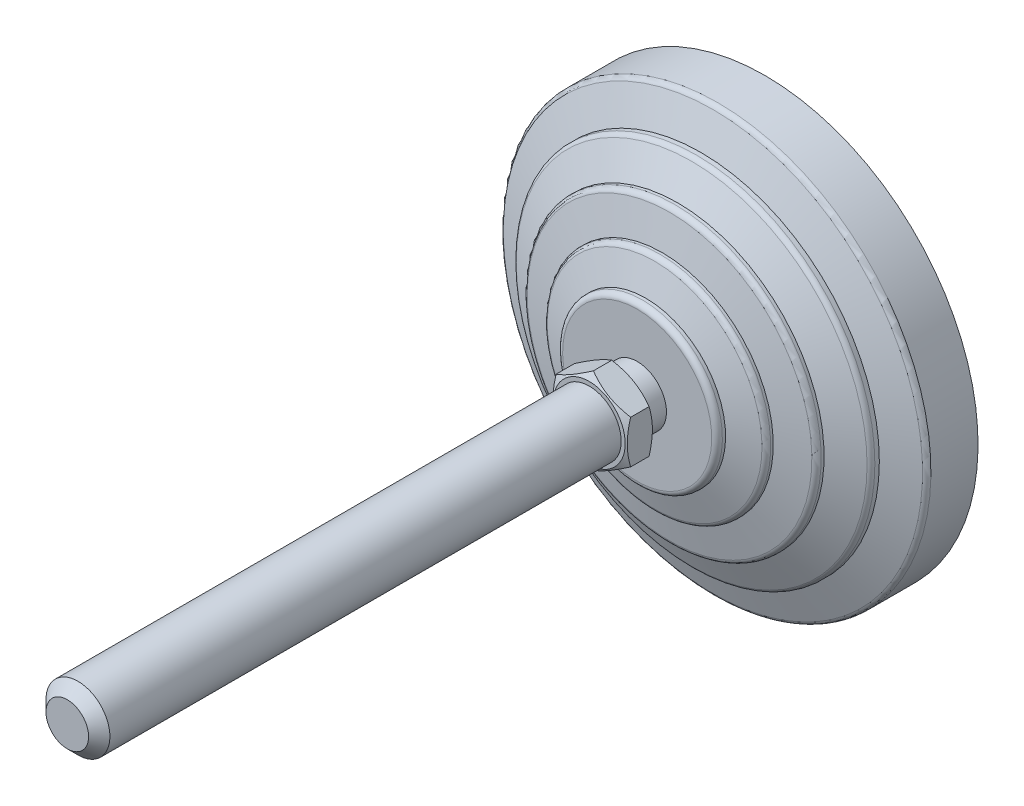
ISO-10303-21;
HEADER;
FILE_DESCRIPTION(('STEP AP214'),'2;1');
FILE_NAME('part.step','',(''),(''),'','','');
FILE_SCHEMA(('AUTOMOTIVE_DESIGN { 1 0 10303 214 1 1 1 1 }'));
ENDSEC;
DATA;
#1=APPLICATION_CONTEXT('core data for automotive mechanical design processes');
#2=APPLICATION_PROTOCOL_DEFINITION('international standard','automotive_design',2000,#1);
#3=PRODUCT_CONTEXT('',#1,'mechanical');
#4=PRODUCT('Part','Part','',(#3));
#5=PRODUCT_RELATED_PRODUCT_CATEGORY('part','',(#4));
#6=PRODUCT_DEFINITION_FORMATION('','',#4);
#7=PRODUCT_DEFINITION_CONTEXT('part definition',#1,'design');
#8=PRODUCT_DEFINITION('design','',#6,#7);
#9=PRODUCT_DEFINITION_SHAPE('','',#8);
#10=(LENGTH_UNIT() NAMED_UNIT(*) SI_UNIT(.MILLI.,.METRE.));
#11=(NAMED_UNIT(*) PLANE_ANGLE_UNIT() SI_UNIT($,.RADIAN.));
#12=(NAMED_UNIT(*) SI_UNIT($,.STERADIAN.) SOLID_ANGLE_UNIT());
#13=UNCERTAINTY_MEASURE_WITH_UNIT(LENGTH_MEASURE(1.E-05),#10,'distance_accuracy_value','');
#14=(GEOMETRIC_REPRESENTATION_CONTEXT(3) GLOBAL_UNCERTAINTY_ASSIGNED_CONTEXT((#13)) GLOBAL_UNIT_ASSIGNED_CONTEXT((#10,
#11,#12)) REPRESENTATION_CONTEXT('',''));
#15=CARTESIAN_POINT('',(0.,0.,0.));
#16=DIRECTION('',(0.,0.,1.));
#17=DIRECTION('',(1.,0.,0.));
#18=AXIS2_PLACEMENT_3D('',#15,#16,#17);
#19=CARTESIAN_POINT('',(-5.5000000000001,0.,28.));
#20=DIRECTION('',(0.,0.,1.));
#21=DIRECTION('',(0.,-1.,0.));
#22=AXIS2_PLACEMENT_3D('',#19,#20,#21);
#23=PLANE('',#22);
#24=CARTESIAN_POINT('',(0.,0.,28.));
#25=DIRECTION('',(0.,0.,-1.));
#26=DIRECTION('',(-1.,0.,0.));
#27=AXIS2_PLACEMENT_3D('',#24,#25,#26);
#28=CIRCLE('',#27,6.75);
#29=CARTESIAN_POINT('',(-6.75,0.,28.));
#30=VERTEX_POINT('',#29);
#31=EDGE_CURVE('E575',#30,#30,#28,.T.);
#32=ORIENTED_EDGE('',*,*,#31,.T.);
#33=EDGE_LOOP('',(#32));
#34=FACE_BOUND('',#33,.T.);
#35=CARTESIAN_POINT('',(0.,0.,28.));
#36=DIRECTION('',(0.,0.,-1.));
#37=DIRECTION('',(0.,1.,0.));
#38=AXIS2_PLACEMENT_3D('',#35,#36,#37);
#39=CIRCLE('',#38,5.5000000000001);
#40=CARTESIAN_POINT('',(0.,5.5000000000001,28.));
#41=VERTEX_POINT('',#40);
#42=EDGE_CURVE('E147',#41,#41,#39,.T.);
#43=ORIENTED_EDGE('',*,*,#42,.F.);
#44=EDGE_LOOP('',(#43));
#45=FACE_BOUND('',#44,.T.);
#46=ADVANCED_FACE('F14',(#34,#45),#23,.F.);
#47=CARTESIAN_POINT('',(0.,0.,0.));
#48=DIRECTION('',(0.,0.,-1.));
#49=DIRECTION('',(0.,1.,0.));
#50=AXIS2_PLACEMENT_3D('',#47,#48,#49);
#51=CYLINDRICAL_SURFACE('',#50,5.5000000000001);
#52=CARTESIAN_POINT('',(0.,0.,24.));
#53=DIRECTION('',(0.,0.,-1.));
#54=DIRECTION('',(0.,1.,0.));
#55=AXIS2_PLACEMENT_3D('',#52,#53,#54);
#56=CIRCLE('',#55,5.5000000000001);
#57=CARTESIAN_POINT('',(0.,5.5000000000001,24.));
#58=VERTEX_POINT('',#57);
#59=EDGE_CURVE('E144',#58,#58,#56,.T.);
#60=ORIENTED_EDGE('',*,*,#59,.F.);
#61=EDGE_LOOP('',(#60));
#62=FACE_BOUND('',#61,.T.);
#63=ORIENTED_EDGE('',*,*,#42,.T.);
#64=EDGE_LOOP('',(#63));
#65=FACE_BOUND('',#64,.T.);
#66=ADVANCED_FACE('F173',(#62,#65),#51,.T.);
#67=CARTESIAN_POINT('',(-5.5000000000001,0.,24.));
#68=DIRECTION('',(0.,0.,-1.));
#69=DIRECTION('',(0.,1.,0.));
#70=AXIS2_PLACEMENT_3D('',#67,#68,#69);
#71=PLANE('',#70);
#72=CARTESIAN_POINT('',(0.,0.,24.));
#73=DIRECTION('',(0.,0.,-1.));
#74=DIRECTION('',(0.,1.,0.));
#75=AXIS2_PLACEMENT_3D('',#72,#73,#74);
#76=CIRCLE('',#75,14.);
#77=CARTESIAN_POINT('',(0.,14.,24.));
#78=VERTEX_POINT('',#77);
#79=EDGE_CURVE('E141',#78,#78,#76,.T.);
#80=ORIENTED_EDGE('',*,*,#79,.F.);
#81=EDGE_LOOP('',(#80));
#82=FACE_BOUND('',#81,.T.);
#83=ORIENTED_EDGE('',*,*,#59,.T.);
#84=EDGE_LOOP('',(#83));
#85=FACE_BOUND('',#84,.T.);
#86=ADVANCED_FACE('F180',(#82,#85),#71,.F.);
#87=CARTESIAN_POINT('',(0.,0.,23.));
#88=DIRECTION('',(0.,0.,-1.));
#89=DIRECTION('',(0.,1.,0.));
#90=AXIS2_PLACEMENT_3D('',#87,#88,#89);
#91=TOROIDAL_SURFACE('',#90,14.,1.);
#92=CARTESIAN_POINT('',(0.,0.,23.));
#93=DIRECTION('',(0.,0.,-1.));
#94=DIRECTION('',(0.,1.,0.));
#95=AXIS2_PLACEMENT_3D('',#92,#93,#94);
#96=CIRCLE('',#95,15.);
#97=CARTESIAN_POINT('',(0.,15.,23.));
#98=VERTEX_POINT('',#97);
#99=EDGE_CURVE('E138',#98,#98,#96,.T.);
#100=ORIENTED_EDGE('',*,*,#99,.F.);
#101=EDGE_LOOP('',(#100));
#102=FACE_BOUND('',#101,.T.);
#103=ORIENTED_EDGE('',*,*,#79,.T.);
#104=EDGE_LOOP('',(#103));
#105=FACE_BOUND('',#104,.T.);
#106=ADVANCED_FACE('F407',(#102,#105),#91,.T.);
#107=CARTESIAN_POINT('',(0.,0.,0.));
#108=DIRECTION('',(0.,0.,-1.));
#109=DIRECTION('',(0.,1.,0.));
#110=AXIS2_PLACEMENT_3D('',#107,#108,#109);
#111=CYLINDRICAL_SURFACE('',#110,15.);
#112=CARTESIAN_POINT('',(0.,0.,22.4025287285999));
#113=DIRECTION('',(0.,0.,-1.));
#114=DIRECTION('',(0.,1.,0.));
#115=AXIS2_PLACEMENT_3D('',#112,#113,#114);
#116=CIRCLE('',#115,15.);
#117=CARTESIAN_POINT('',(0.,15.,22.4025287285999));
#118=VERTEX_POINT('',#117);
#119=EDGE_CURVE('E135',#118,#118,#116,.T.);
#120=ORIENTED_EDGE('',*,*,#119,.F.);
#121=EDGE_LOOP('',(#120));
#122=FACE_BOUND('',#121,.T.);
#123=ORIENTED_EDGE('',*,*,#99,.T.);
#124=EDGE_LOOP('',(#123));
#125=FACE_BOUND('',#124,.T.);
#126=ADVANCED_FACE('F397',(#122,#125),#111,.T.);
#127=CARTESIAN_POINT('',(0.,0.,22.4025287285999));
#128=DIRECTION('',(0.,0.,-1.));
#129=DIRECTION('',(0.,1.,0.));
#130=AXIS2_PLACEMENT_3D('',#127,#128,#129);
#131=CONICAL_SURFACE('',#130,15.,1.25589726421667);
#132=CARTESIAN_POINT('',(0.,0.,20.7216684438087));
#133=DIRECTION('',(0.,0.,-1.));
#134=DIRECTION('',(0.,1.,0.));
#135=AXIS2_PLACEMENT_3D('',#132,#133,#134);
#136=CIRCLE('',#135,20.16016354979);
#137=CARTESIAN_POINT('',(0.,20.16016354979,20.7216684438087));
#138=VERTEX_POINT('',#137);
#139=EDGE_CURVE('E132',#138,#138,#136,.T.);
#140=ORIENTED_EDGE('',*,*,#139,.F.);
#141=EDGE_LOOP('',(#140));
#142=FACE_BOUND('',#141,.T.);
#143=ORIENTED_EDGE('',*,*,#119,.T.);
#144=EDGE_LOOP('',(#143));
#145=FACE_BOUND('',#144,.T.);
#146=ADVANCED_FACE('F387',(#142,#145),#131,.T.);
#147=CARTESIAN_POINT('',(0.,0.,19.7708407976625));
#148=DIRECTION('',(0.,0.,-1.));
#149=DIRECTION('',(0.,1.,0.));
#150=AXIS2_PLACEMENT_3D('',#147,#148,#149);
#151=TOROIDAL_SURFACE('',#150,19.8504430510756,1.);
#152=CARTESIAN_POINT('',(0.,0.,19.7708407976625));
#153=DIRECTION('',(0.,0.,-1.));
#154=DIRECTION('',(0.,1.,0.));
#155=AXIS2_PLACEMENT_3D('',#152,#153,#154);
#156=CIRCLE('',#155,20.8504430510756);
#157=CARTESIAN_POINT('',(0.,20.8504430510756,19.7708407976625));
#158=VERTEX_POINT('',#157);
#159=EDGE_CURVE('E129',#158,#158,#156,.T.);
#160=ORIENTED_EDGE('',*,*,#159,.F.);
#161=EDGE_LOOP('',(#160));
#162=FACE_BOUND('',#161,.T.);
#163=ORIENTED_EDGE('',*,*,#139,.T.);
#164=EDGE_LOOP('',(#163));
#165=FACE_BOUND('',#164,.T.);
#166=ADVANCED_FACE('F377',(#162,#165),#151,.T.);
#167=CARTESIAN_POINT('',(0.,0.,0.));
#168=DIRECTION('',(0.,0.,-1.));
#169=DIRECTION('',(0.,1.,0.));
#170=AXIS2_PLACEMENT_3D('',#167,#168,#169);
#171=CYLINDRICAL_SURFACE('',#170,20.8504430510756);
#172=CARTESIAN_POINT('',(0.,0.,19.2987385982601));
#173=DIRECTION('',(0.,0.,-1.));
#174=DIRECTION('',(0.,1.,0.));
#175=AXIS2_PLACEMENT_3D('',#172,#173,#174);
#176=CIRCLE('',#175,20.8504430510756);
#177=CARTESIAN_POINT('',(0.,20.8504430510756,19.2987385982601));
#178=VERTEX_POINT('',#177);
#179=EDGE_CURVE('E126',#178,#178,#176,.T.);
#180=ORIENTED_EDGE('',*,*,#179,.F.);
#181=EDGE_LOOP('',(#180));
#182=FACE_BOUND('',#181,.T.);
#183=ORIENTED_EDGE('',*,*,#159,.T.);
#184=EDGE_LOOP('',(#183));
#185=FACE_BOUND('',#184,.T.);
#186=ADVANCED_FACE('F367',(#182,#185),#171,.T.);
#187=CARTESIAN_POINT('',(0.,0.,19.2987385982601));
#188=DIRECTION('',(0.,0.,-1.));
#189=DIRECTION('',(0.,1.,0.));
#190=AXIS2_PLACEMENT_3D('',#187,#188,#189);
#191=CONICAL_SURFACE('',#190,20.8504430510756,1.34067144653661);
#192=CARTESIAN_POINT('',(0.,0.,17.9217501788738));
#193=DIRECTION('',(0.,0.,-1.));
#194=DIRECTION('',(0.,1.,0.));
#195=AXIS2_PLACEMENT_3D('',#192,#193,#194);
#196=CIRCLE('',#195,26.7280991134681);
#197=CARTESIAN_POINT('',(0.,26.7280991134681,17.9217501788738));
#198=VERTEX_POINT('',#197);
#199=EDGE_CURVE('E123',#198,#198,#196,.T.);
#200=ORIENTED_EDGE('',*,*,#199,.F.);
#201=EDGE_LOOP('',(#200));
#202=FACE_BOUND('',#201,.T.);
#203=ORIENTED_EDGE('',*,*,#179,.T.);
#204=EDGE_LOOP('',(#203));
#205=FACE_BOUND('',#204,.T.);
#206=ADVANCED_FACE('F357',(#202,#205),#191,.T.);
#207=CARTESIAN_POINT('',(0.,0.,16.9481122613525));
#208=DIRECTION('',(0.,0.,-1.));
#209=DIRECTION('',(0.,1.,0.));
#210=AXIS2_PLACEMENT_3D('',#207,#208,#209);
#211=TOROIDAL_SURFACE('',#210,26.5,1.00000000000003);
#212=CARTESIAN_POINT('',(0.,0.,16.9481122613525));
#213=DIRECTION('',(0.,0.,-1.));
#214=DIRECTION('',(0.,1.,0.));
#215=AXIS2_PLACEMENT_3D('',#212,#213,#214);
#216=CIRCLE('',#215,27.5);
#217=CARTESIAN_POINT('',(0.,27.5,16.9481122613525));
#218=VERTEX_POINT('',#217);
#219=EDGE_CURVE('E120',#218,#218,#216,.T.);
#220=ORIENTED_EDGE('',*,*,#219,.F.);
#221=EDGE_LOOP('',(#220));
#222=FACE_BOUND('',#221,.T.);
#223=ORIENTED_EDGE('',*,*,#199,.T.);
#224=EDGE_LOOP('',(#223));
#225=FACE_BOUND('',#224,.T.);
#226=ADVANCED_FACE('F347',(#222,#225),#211,.T.);
#227=CARTESIAN_POINT('',(0.,0.,0.));
#228=DIRECTION('',(0.,0.,-1.));
#229=DIRECTION('',(0.,1.,0.));
#230=AXIS2_PLACEMENT_3D('',#227,#228,#229);
#231=CYLINDRICAL_SURFACE('',#230,27.5);
#232=CARTESIAN_POINT('',(0.,0.,16.4025287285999));
#233=DIRECTION('',(0.,0.,-1.));
#234=DIRECTION('',(0.,1.,0.));
#235=AXIS2_PLACEMENT_3D('',#232,#233,#234);
#236=CIRCLE('',#235,27.5);
#237=CARTESIAN_POINT('',(0.,27.5,16.4025287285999));
#238=VERTEX_POINT('',#237);
#239=EDGE_CURVE('E117',#238,#238,#236,.T.);
#240=ORIENTED_EDGE('',*,*,#239,.F.);
#241=EDGE_LOOP('',(#240));
#242=FACE_BOUND('',#241,.T.);
#243=ORIENTED_EDGE('',*,*,#219,.T.);
#244=EDGE_LOOP('',(#243));
#245=FACE_BOUND('',#244,.T.);
#246=ADVANCED_FACE('F337',(#242,#245),#231,.T.);
#247=CARTESIAN_POINT('',(0.,0.,16.4025287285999));
#248=DIRECTION('',(0.,0.,-1.));
#249=DIRECTION('',(0.,1.,0.));
#250=AXIS2_PLACEMENT_3D('',#247,#248,#249);
#251=CONICAL_SURFACE('',#250,27.5,1.1202291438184);
#252=CARTESIAN_POINT('',(0.,0.,13.7730910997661));
#253=DIRECTION('',(0.,0.,-1.));
#254=DIRECTION('',(0.,1.,0.));
#255=AXIS2_PLACEMENT_3D('',#252,#253,#254);
#256=CIRCLE('',#255,32.9354761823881);
#257=CARTESIAN_POINT('',(0.,32.9354761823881,13.7730910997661));
#258=VERTEX_POINT('',#257);
#259=EDGE_CURVE('E114',#258,#258,#256,.T.);
#260=ORIENTED_EDGE('',*,*,#259,.F.);
#261=EDGE_LOOP('',(#260));
#262=FACE_BOUND('',#261,.T.);
#263=ORIENTED_EDGE('',*,*,#239,.T.);
#264=EDGE_LOOP('',(#263));
#265=FACE_BOUND('',#264,.T.);
#266=ADVANCED_FACE('F327',(#262,#265),#251,.T.);
#267=CARTESIAN_POINT('',(0.,0.,12.8728908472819));
#268=DIRECTION('',(0.,0.,-1.));
#269=DIRECTION('',(0.,1.,0.));
#270=AXIS2_PLACEMENT_3D('',#267,#268,#269);
#271=TOROIDAL_SURFACE('',#270,32.5,0.999999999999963);
#272=CARTESIAN_POINT('',(0.,0.,12.8728908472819));
#273=DIRECTION('',(0.,0.,-1.));
#274=DIRECTION('',(0.,1.,0.));
#275=AXIS2_PLACEMENT_3D('',#272,#273,#274);
#276=CIRCLE('',#275,33.5);
#277=CARTESIAN_POINT('',(0.,33.5,12.8728908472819));
#278=VERTEX_POINT('',#277);
#279=EDGE_CURVE('E111',#278,#278,#276,.T.);
#280=ORIENTED_EDGE('',*,*,#279,.F.);
#281=EDGE_LOOP('',(#280));
#282=FACE_BOUND('',#281,.T.);
#283=ORIENTED_EDGE('',*,*,#259,.T.);
#284=EDGE_LOOP('',(#283));
#285=FACE_BOUND('',#284,.T.);
#286=ADVANCED_FACE('F317',(#282,#285),#271,.T.);
#287=CARTESIAN_POINT('',(0.,0.,0.));
#288=DIRECTION('',(0.,0.,-1.));
#289=DIRECTION('',(0.,1.,0.));
#290=AXIS2_PLACEMENT_3D('',#287,#288,#289);
#291=CYLINDRICAL_SURFACE('',#290,33.5);
#292=CARTESIAN_POINT('',(0.,0.,12.0315037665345));
#293=DIRECTION('',(0.,0.,-1.));
#294=DIRECTION('',(0.,1.,0.));
#295=AXIS2_PLACEMENT_3D('',#292,#293,#294);
#296=CIRCLE('',#295,33.5);
#297=CARTESIAN_POINT('',(0.,33.5,12.0315037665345));
#298=VERTEX_POINT('',#297);
#299=EDGE_CURVE('E108',#298,#298,#296,.T.);
#300=ORIENTED_EDGE('',*,*,#299,.F.);
#301=EDGE_LOOP('',(#300));
#302=FACE_BOUND('',#301,.T.);
#303=ORIENTED_EDGE('',*,*,#279,.T.);
#304=EDGE_LOOP('',(#303));
#305=FACE_BOUND('',#304,.T.);
#306=ADVANCED_FACE('F307',(#302,#305),#291,.T.);
#307=CARTESIAN_POINT('',(0.,0.,12.0315037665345));
#308=DIRECTION('',(0.,0.,-1.));
#309=DIRECTION('',(0.,1.,0.));
#310=AXIS2_PLACEMENT_3D('',#307,#308,#309);
#311=CONICAL_SURFACE('',#310,33.5,1.20362249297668);
#312=CARTESIAN_POINT('',(0.,0.,9.77805027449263));
#313=DIRECTION('',(0.,0.,-1.));
#314=DIRECTION('',(0.,1.,0.));
#315=AXIS2_PLACEMENT_3D('',#312,#313,#314);
#316=CIRCLE('',#315,39.3589790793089);
#317=CARTESIAN_POINT('',(0.,39.3589790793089,9.77805027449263));
#318=VERTEX_POINT('',#317);
#319=EDGE_CURVE('E105',#318,#318,#316,.T.);
#320=ORIENTED_EDGE('',*,*,#319,.F.);
#321=EDGE_LOOP('',(#320));
#322=FACE_BOUND('',#321,.T.);
#323=ORIENTED_EDGE('',*,*,#299,.T.);
#324=EDGE_LOOP('',(#323));
#325=FACE_BOUND('',#324,.T.);
#326=ADVANCED_FACE('F297',(#322,#325),#311,.T.);
#327=CARTESIAN_POINT('',(0.,0.,8.84470466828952));
#328=DIRECTION('',(0.,0.,-1.));
#329=DIRECTION('',(0.,1.,0.));
#330=AXIS2_PLACEMENT_3D('',#327,#328,#329);
#331=TOROIDAL_SURFACE('',#330,39.,1.00000000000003);
#332=CARTESIAN_POINT('',(0.,0.,8.84470466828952));
#333=DIRECTION('',(0.,0.,-1.));
#334=DIRECTION('',(0.,1.,0.));
#335=AXIS2_PLACEMENT_3D('',#332,#333,#334);
#336=CIRCLE('',#335,40.);
#337=CARTESIAN_POINT('',(0.,40.,8.84470466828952));
#338=VERTEX_POINT('',#337);
#339=EDGE_CURVE('E102',#338,#338,#336,.T.);
#340=ORIENTED_EDGE('',*,*,#339,.F.);
#341=EDGE_LOOP('',(#340));
#342=FACE_BOUND('',#341,.T.);
#343=ORIENTED_EDGE('',*,*,#319,.T.);
#344=EDGE_LOOP('',(#343));
#345=FACE_BOUND('',#344,.T.);
#346=ADVANCED_FACE('F287',(#342,#345),#331,.T.);
#347=CARTESIAN_POINT('',(0.,0.,0.));
#348=DIRECTION('',(0.,0.,-1.));
#349=DIRECTION('',(0.,1.,0.));
#350=AXIS2_PLACEMENT_3D('',#347,#348,#349);
#351=CYLINDRICAL_SURFACE('',#350,40.);
#352=CARTESIAN_POINT('',(0.,0.,0.));
#353=DIRECTION('',(0.,0.,-1.));
#354=DIRECTION('',(0.,1.,0.));
#355=AXIS2_PLACEMENT_3D('',#352,#353,#354);
#356=CIRCLE('',#355,40.);
#357=CARTESIAN_POINT('',(0.,40.,0.));
#358=VERTEX_POINT('',#357);
#359=EDGE_CURVE('E99',#358,#358,#356,.T.);
#360=ORIENTED_EDGE('',*,*,#359,.F.);
#361=EDGE_LOOP('',(#360));
#362=FACE_BOUND('',#361,.T.);
#363=ORIENTED_EDGE('',*,*,#339,.T.);
#364=EDGE_LOOP('',(#363));
#365=FACE_BOUND('',#364,.T.);
#366=ADVANCED_FACE('F277',(#362,#365),#351,.T.);
#367=CARTESIAN_POINT('',(0.,0.,0.));
#368=DIRECTION('',(0.,0.,1.));
#369=DIRECTION('',(0.,-1.,0.));
#370=AXIS2_PLACEMENT_3D('',#367,#368,#369);
#371=PLANE('',#370);
#372=ORIENTED_EDGE('',*,*,#359,.T.);
#373=EDGE_LOOP('',(#372));
#374=FACE_BOUND('',#373,.T.);
#375=ADVANCED_FACE('F169',(#374),#371,.F.);
#376=CARTESIAN_POINT('',(0.,0.,29.8574713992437));
#377=DIRECTION('',(0.,0.,1.));
#378=DIRECTION('',(1.,0.,0.));
#379=AXIS2_PLACEMENT_3D('',#376,#377,#378);
#380=CONICAL_SURFACE('',#379,9.96723483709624,1.0471975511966);
#381=CARTESIAN_POINT('',(0.000200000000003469,-8.0830192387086,28.7696190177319));
#382=CARTESIAN_POINT('',(-0.153667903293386,-7.99418356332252,28.7183374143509));
#383=CARTESIAN_POINT('',(-0.308109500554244,-7.90501666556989,28.669383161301));
#384=CARTESIAN_POINT('',(-0.618246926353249,-7.72595873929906,28.5767703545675));
#385=CARTESIAN_POINT('',(-0.773943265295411,-7.63606741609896,28.5331140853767));
#386=CARTESIAN_POINT('',(-1.24352516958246,-7.36495417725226,28.4109491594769));
#387=CARTESIAN_POINT('',(-1.5592643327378,-7.18266208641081,28.3414631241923));
#388=CARTESIAN_POINT('',(-2.03176224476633,-6.90986528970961,28.2599825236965));
#389=CARTESIAN_POINT('',(-2.18710922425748,-6.82017566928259,28.2367710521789));
#390=CARTESIAN_POINT('',(-2.49850511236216,-6.64039116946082,28.1978487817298));
#391=CARTESIAN_POINT('',(-2.6545539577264,-6.55029632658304,28.1821373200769));
#392=CARTESIAN_POINT('',(-2.96692267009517,-6.36995016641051,28.1586154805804));
#393=CARTESIAN_POINT('',(-3.12324202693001,-6.27969914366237,28.1507961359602));
#394=CARTESIAN_POINT('',(-3.43601650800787,-6.09911871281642,28.1432178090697));
#395=CARTESIAN_POINT('',(-3.59247162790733,-6.00878930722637,28.1434585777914));
#396=CARTESIAN_POINT('',(-4.02110687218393,-5.76131663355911,28.155197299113));
#397=CARTESIAN_POINT('',(-4.2931466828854,-5.60425437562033,28.1749033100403));
#398=CARTESIAN_POINT('',(-4.8354194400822,-5.29117305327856,28.2373910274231));
#399=CARTESIAN_POINT('',(-5.10565047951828,-5.13515508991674,28.2801940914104));
#400=CARTESIAN_POINT('',(-5.64901454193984,-4.82144370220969,28.3871892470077));
#401=CARTESIAN_POINT('',(-5.92207900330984,-4.6637898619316,28.451834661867));
#402=CARTESIAN_POINT('',(-6.46413578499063,-4.35083323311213,28.5985536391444));
#403=CARTESIAN_POINT('',(-6.73313504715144,-4.19552643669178,28.6805927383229));
#404=CARTESIAN_POINT('',(-7.0002,-4.04133641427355,28.7696190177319));
#405=B_SPLINE_CURVE_WITH_KNOTS('',3,(#381,#382,#383,#384,#385,#386,#387,#388,#389,#390,#391,
#392,#393,#394,#395,#396,#397,#398,#399,#400,#401,#402,#403,#404),.UNSPECIFIED.,.F.,.F.,(4,2,2,
2,2,2,2,2,2,2,2,4),(0.,0.554727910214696,1.10969417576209,2.2219327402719,2.76443041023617,
3.30688013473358,3.8487128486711,4.3905288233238,5.33376515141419,6.27787517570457,
7.24292418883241,8.20607866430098),.UNSPECIFIED.);
#406=CARTESIAN_POINT('',(0.,-8.08290376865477,28.7695523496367));
#407=VERTEX_POINT('',#406);
#408=CARTESIAN_POINT('',(-7.,-4.04145188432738,28.7695523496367));
#409=VERTEX_POINT('',#408);
#410=EDGE_CURVE('E73',#407,#409,#405,.T.);
#411=ORIENTED_EDGE('',*,*,#410,.T.);
#412=CARTESIAN_POINT('',(-7.,-10.849956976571,31.5576731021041));
#413=CARTESIAN_POINT('',(-7.,-10.5442694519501,31.4094108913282));
#414=CARTESIAN_POINT('',(-7.,-10.2378795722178,31.2625719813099));
#415=CARTESIAN_POINT('',(-7.,-9.62332155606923,30.9725413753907));
#416=CARTESIAN_POINT('',(-7.,-9.31515314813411,30.829350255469));
#417=CARTESIAN_POINT('',(-7.,-8.69507395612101,30.546694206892));
#418=CARTESIAN_POINT('',(-7.,-8.38315192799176,30.4072538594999));
#419=CARTESIAN_POINT('',(-7.,-7.75682494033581,30.1340873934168));
#420=CARTESIAN_POINT('',(-7.,-7.44242009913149,30.0003610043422));
#421=CARTESIAN_POINT('',(-7.,-6.80050284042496,29.7359611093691));
#422=CARTESIAN_POINT('',(-7.,-6.4728931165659,29.6055225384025));
#423=CARTESIAN_POINT('',(-7.,-5.81383948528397,29.3545316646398));
#424=CARTESIAN_POINT('',(-7.,-5.48239515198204,29.2339804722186));
#425=CARTESIAN_POINT('',(-7.,-4.81576323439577,29.0059337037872));
#426=CARTESIAN_POINT('',(-7.,-4.48058480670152,28.8984116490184));
#427=CARTESIAN_POINT('',(-7.,-3.80543206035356,28.6998758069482));
#428=CARTESIAN_POINT('',(-7.,-3.46545929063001,28.6088568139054));
#429=CARTESIAN_POINT('',(-7.,-2.78235354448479,28.448188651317));
#430=CARTESIAN_POINT('',(-7.,-2.43924851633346,28.3784238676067));
#431=CARTESIAN_POINT('',(-7.,-1.92147123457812,28.2927407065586));
#432=CARTESIAN_POINT('',(-7.,-1.74834609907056,28.2673391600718));
#433=CARTESIAN_POINT('',(-7.,-1.40123730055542,28.2233557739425));
#434=CARTESIAN_POINT('',(-7.,-1.22725372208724,28.204773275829));
#435=CARTESIAN_POINT('',(-7.,-0.880931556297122,28.1750309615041));
#436=CARTESIAN_POINT('',(-7.,-0.708601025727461,28.1637776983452));
#437=CARTESIAN_POINT('',(-7.,-0.363618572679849,28.1485682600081));
#438=CARTESIAN_POINT('',(-7.,-0.190966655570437,28.1446119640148));
#439=CARTESIAN_POINT('',(-7.,0.154350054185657,28.144090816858));
#440=CARTESIAN_POINT('',(-7.,0.327014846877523,28.1475259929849));
#441=CARTESIAN_POINT('',(-7.,0.672046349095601,28.1617039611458));
#442=CARTESIAN_POINT('',(-7.,0.844413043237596,28.1724471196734));
#443=CARTESIAN_POINT('',(-7.,1.258837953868,28.2068356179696));
#444=CARTESIAN_POINT('',(-7.,1.50061370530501,28.2339580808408));
#445=CARTESIAN_POINT('',(-7.,1.9823555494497,28.3011004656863));
#446=CARTESIAN_POINT('',(-7.,2.22232139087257,28.3411221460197));
#447=CARTESIAN_POINT('',(-7.,2.93923811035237,28.478412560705));
#448=CARTESIAN_POINT('',(-7.,3.41293789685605,28.5928812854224));
#449=CARTESIAN_POINT('',(-7.,4.1212407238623,28.7911934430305));
#450=CARTESIAN_POINT('',(-7.,4.35952233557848,28.8626523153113));
#451=CARTESIAN_POINT('',(-7.,4.83377085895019,29.0129456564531));
#452=CARTESIAN_POINT('',(-7.,5.06973775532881,29.0917801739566));
#453=CARTESIAN_POINT('',(-7.,5.53943199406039,29.2555637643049));
#454=CARTESIAN_POINT('',(-7.,5.77316005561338,29.3405107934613));
#455=CARTESIAN_POINT('',(-7.,6.23868273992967,29.5155245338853));
#456=CARTESIAN_POINT('',(-7.,6.47047738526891,29.6055911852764));
#457=CARTESIAN_POINT('',(-7.,7.0172445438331,29.8238878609));
#458=CARTESIAN_POINT('',(-7.,7.33147347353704,29.9539768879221));
#459=CARTESIAN_POINT('',(-7.,7.95726292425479,30.2204404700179));
#460=CARTESIAN_POINT('',(-7.,8.26882328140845,30.3568154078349));
#461=CARTESIAN_POINT('',(-7.,8.8897663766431,30.6345885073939));
#462=CARTESIAN_POINT('',(-7.,9.19914866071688,30.7759876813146));
#463=CARTESIAN_POINT('',(-7.,9.8160485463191,31.0628039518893));
#464=CARTESIAN_POINT('',(-7.,10.1235661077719,31.2082211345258));
#465=CARTESIAN_POINT('',(-7.,10.7373637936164,31.5024734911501));
#466=CARTESIAN_POINT('',(-7.,11.0436422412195,31.6513121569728));
#467=CARTESIAN_POINT('',(-7.,11.654879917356,31.9516765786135));
#468=CARTESIAN_POINT('',(-7.,11.9598391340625,32.1032023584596));
#469=CARTESIAN_POINT('',(-7.,12.8729719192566,32.5610551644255));
#470=CARTESIAN_POINT('',(-7.,13.4794829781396,32.8706974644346));
#471=CARTESIAN_POINT('',(-7.,14.6385336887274,33.469959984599));
#472=CARTESIAN_POINT('',(-7.,15.1913327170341,33.7590807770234));
#473=CARTESIAN_POINT('',(-7.,16.2948779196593,34.3412581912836));
#474=CARTESIAN_POINT('',(-7.,16.8456240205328,34.6343149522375));
#475=CARTESIAN_POINT('',(-7.,17.9441433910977,35.2226913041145));
#476=CARTESIAN_POINT('',(-7.,18.4919206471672,35.5180034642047));
#477=CARTESIAN_POINT('',(-7.,19.5861626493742,36.110978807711));
#478=CARTESIAN_POINT('',(-7.,20.1326274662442,36.4086418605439));
#479=CARTESIAN_POINT('',(-7.,20.678609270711,36.7071823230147));
#480=B_SPLINE_CURVE_WITH_KNOTS('',3,(#412,#413,#414,#415,#416,#417,#418,#419,#420,#421,#422,
#423,#424,#425,#426,#427,#428,#429,#430,#431,#432,#433,#434,#435,#436,#437,#438,#439,#440,#441,
#442,#443,#444,#445,#446,#447,#448,#449,#450,#451,#452,#453,#454,#455,#456,#457,#458,#459,#460,
#461,#462,#463,#464,#465,#466,#467,#468,#469,#470,#471,#472,#473,#474,#475,#476,#477,#478,#479),
.UNSPECIFIED.,.F.,.F.,(4,2,2,2,2,2,2,2,2,2,2,2,2,2,2,2,2,2,2,2,2,2,2,2,2,2,2,2,2,2,2,2,2,4),(0.,
1.01924694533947,2.03865384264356,3.06362043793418,4.08853847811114,5.14628097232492,
6.20414209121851,7.25981594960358,8.31515622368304,9.36464893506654,9.88947191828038,
10.4142442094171,10.9321874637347,11.4501221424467,11.9680587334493,12.4860213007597,
13.2154858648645,13.9450499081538,15.4049887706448,16.1512248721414,16.8974658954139,
17.6434585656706,18.3894425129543,19.4096280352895,20.4298757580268,21.4503301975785,
22.4708064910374,23.4923750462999,24.5139527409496,26.5568337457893,28.4283398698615,
30.2999123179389,32.1668349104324,34.0336545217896),.UNSPECIFIED.);
#481=CARTESIAN_POINT('',(-7.,4.04145188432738,28.7695523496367));
#482=VERTEX_POINT('',#481);
#483=EDGE_CURVE('E81',#409,#482,#480,.T.);
#484=ORIENTED_EDGE('',*,*,#483,.T.);
#485=CARTESIAN_POINT('',(-7.0002,4.04133641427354,28.7696190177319));
#486=CARTESIAN_POINT('',(-6.84633209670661,4.13017208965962,28.7183374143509));
#487=CARTESIAN_POINT('',(-6.69189049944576,4.21933898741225,28.669383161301));
#488=CARTESIAN_POINT('',(-6.38175307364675,4.39839691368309,28.5767703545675));
#489=CARTESIAN_POINT('',(-6.22605673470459,4.48828823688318,28.5331140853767));
#490=CARTESIAN_POINT('',(-5.75647483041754,4.75940147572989,28.4109491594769));
#491=CARTESIAN_POINT('',(-5.4407356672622,4.94169356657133,28.3414631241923));
#492=CARTESIAN_POINT('',(-4.96823775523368,5.21449036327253,28.2599825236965));
#493=CARTESIAN_POINT('',(-4.81289077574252,5.30417998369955,28.2367710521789));
#494=CARTESIAN_POINT('',(-4.50149488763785,5.48396448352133,28.1978487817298));
#495=CARTESIAN_POINT('',(-4.3454460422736,5.5740593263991,28.1821373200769));
#496=CARTESIAN_POINT('',(-4.03307732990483,5.75440548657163,28.1586154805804));
#497=CARTESIAN_POINT('',(-3.87675797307,5.84465650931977,28.1507961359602));
#498=CARTESIAN_POINT('',(-3.56398349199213,6.02523694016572,28.1432178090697));
#499=CARTESIAN_POINT('',(-3.40752837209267,6.11556634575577,28.1434585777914));
#500=CARTESIAN_POINT('',(-2.97889312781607,6.36303901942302,28.155197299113));
#501=CARTESIAN_POINT('',(-2.70685331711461,6.52010127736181,28.1749033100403));
#502=CARTESIAN_POINT('',(-2.16458055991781,6.83318259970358,28.2373910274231));
#503=CARTESIAN_POINT('',(-1.89434952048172,6.9892005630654,28.2801940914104));
#504=CARTESIAN_POINT('',(-1.35098545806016,7.30291195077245,28.3871892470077));
#505=CARTESIAN_POINT('',(-1.07792099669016,7.46056579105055,28.451834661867));
#506=CARTESIAN_POINT('',(-0.535864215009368,7.77352241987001,28.5985536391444));
#507=CARTESIAN_POINT('',(-0.266864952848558,7.92882921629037,28.6805927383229));
#508=CARTESIAN_POINT('',(0.000199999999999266,8.0830192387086,28.7696190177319));
#509=B_SPLINE_CURVE_WITH_KNOTS('',3,(#485,#486,#487,#488,#489,#490,#491,#492,#493,#494,#495,
#496,#497,#498,#499,#500,#501,#502,#503,#504,#505,#506,#507,#508),.UNSPECIFIED.,.F.,.F.,(4,2,2,
2,2,2,2,2,2,2,2,4),(0.,0.554727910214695,1.10969417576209,2.2219327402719,2.76443041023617,
3.30688013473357,3.8487128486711,4.39052882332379,5.33376515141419,6.27787517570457,
7.24292418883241,8.20607866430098),.UNSPECIFIED.);
#510=CARTESIAN_POINT('',(0.,8.08290376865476,28.7695523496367));
#511=VERTEX_POINT('',#510);
#512=EDGE_CURVE('E530',#482,#511,#509,.T.);
#513=ORIENTED_EDGE('',*,*,#512,.T.);
#514=CARTESIAN_POINT('',(-0.000200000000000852,8.0830192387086,28.7696190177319));
#515=CARTESIAN_POINT('',(0.153667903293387,7.99418356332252,28.7183374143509));
#516=CARTESIAN_POINT('',(0.308109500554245,7.90501666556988,28.669383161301));
#517=CARTESIAN_POINT('',(0.618246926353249,7.72595873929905,28.5767703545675));
#518=CARTESIAN_POINT('',(0.773943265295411,7.63606741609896,28.5331140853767));
#519=CARTESIAN_POINT('',(1.24352516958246,7.36495417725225,28.4109491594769));
#520=CARTESIAN_POINT('',(1.5592643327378,7.18266208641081,28.3414631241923));
#521=CARTESIAN_POINT('',(2.03176224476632,6.9098652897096,28.2599825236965));
#522=CARTESIAN_POINT('',(2.18710922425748,6.82017566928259,28.2367710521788));
#523=CARTESIAN_POINT('',(2.49850511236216,6.64039116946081,28.1978487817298));
#524=CARTESIAN_POINT('',(2.6545539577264,6.55029632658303,28.1821373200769));
#525=CARTESIAN_POINT('',(2.96692267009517,6.36995016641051,28.1586154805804));
#526=CARTESIAN_POINT('',(3.12324202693,6.27969914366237,28.1507961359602));
#527=CARTESIAN_POINT('',(3.43601650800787,6.09911871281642,28.1432178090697));
#528=CARTESIAN_POINT('',(3.59247162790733,6.00878930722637,28.1434585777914));
#529=CARTESIAN_POINT('',(4.02110687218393,5.76131663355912,28.155197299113));
#530=CARTESIAN_POINT('',(4.2931466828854,5.60425437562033,28.1749033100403));
#531=CARTESIAN_POINT('',(4.8354194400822,5.29117305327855,28.2373910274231));
#532=CARTESIAN_POINT('',(5.10565047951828,5.13515508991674,28.2801940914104));
#533=CARTESIAN_POINT('',(5.64901454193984,4.82144370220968,28.3871892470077));
#534=CARTESIAN_POINT('',(5.92207900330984,4.66378986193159,28.451834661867));
#535=CARTESIAN_POINT('',(6.46413578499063,4.35083323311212,28.5985536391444));
#536=CARTESIAN_POINT('',(6.73313504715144,4.19552643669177,28.6805927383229));
#537=CARTESIAN_POINT('',(7.0002,4.04133641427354,28.7696190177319));
#538=B_SPLINE_CURVE_WITH_KNOTS('',3,(#514,#515,#516,#517,#518,#519,#520,#521,#522,#523,#524,
#525,#526,#527,#528,#529,#530,#531,#532,#533,#534,#535,#536,#537),.UNSPECIFIED.,.F.,.F.,(4,2,2,
2,2,2,2,2,2,2,2,4),(0.,0.554727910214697,1.1096941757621,2.2219327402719,2.76443041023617,
3.30688013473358,3.8487128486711,4.39052882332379,5.33376515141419,6.27787517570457,
7.24292418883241,8.20607866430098),.UNSPECIFIED.);
#539=CARTESIAN_POINT('',(7.,4.04145188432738,28.7695523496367));
#540=VERTEX_POINT('',#539);
#541=EDGE_CURVE('E525',#511,#540,#538,.T.);
#542=ORIENTED_EDGE('',*,*,#541,.T.);
#543=CARTESIAN_POINT('',(7.,-10.8499569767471,31.5576731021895));
#544=CARTESIAN_POINT('',(7.,-10.5442694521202,31.4094108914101));
#545=CARTESIAN_POINT('',(7.,-10.237879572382,31.2625719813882));
#546=CARTESIAN_POINT('',(7.,-9.62332155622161,30.9725413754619));
#547=CARTESIAN_POINT('',(7.,-9.31515314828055,30.8293502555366));
#548=CARTESIAN_POINT('',(7.,-8.69507395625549,30.5466942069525));
#549=CARTESIAN_POINT('',(7.,-8.38315192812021,30.4072538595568));
#550=CARTESIAN_POINT('',(7.,-7.75682494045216,30.1340873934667));
#551=CARTESIAN_POINT('',(7.,-7.44242009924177,30.0003610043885));
#552=CARTESIAN_POINT('',(7.,-6.80050284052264,29.7359611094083));
#553=CARTESIAN_POINT('',(7.,-6.47289311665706,29.6055225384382));
#554=CARTESIAN_POINT('',(7.,-5.81383948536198,29.3545316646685));
#555=CARTESIAN_POINT('',(7.,-5.48239515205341,29.2339804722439));
#556=CARTESIAN_POINT('',(7.,-4.81576323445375,29.0059337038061));
#557=CARTESIAN_POINT('',(7.,-4.48058480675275,28.8984116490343));
#558=CARTESIAN_POINT('',(7.,-3.80543206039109,28.6998758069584));
#559=CARTESIAN_POINT('',(7.,-3.4654592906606,28.6088568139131));
#560=CARTESIAN_POINT('',(7.,-2.78235354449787,28.4481886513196));
#561=CARTESIAN_POINT('',(7.,-2.43924851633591,28.3784238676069));
#562=CARTESIAN_POINT('',(7.,-1.92147123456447,28.2927407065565));
#563=CARTESIAN_POINT('',(7.,-1.7483460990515,28.267339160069));
#564=CARTESIAN_POINT('',(7.,-1.40123730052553,28.223355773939));
#565=CARTESIAN_POINT('',(7.,-1.2272537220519,28.2047732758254));
#566=CARTESIAN_POINT('',(7.,-0.880931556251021,28.1750309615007));
#567=CARTESIAN_POINT('',(7.,-0.708601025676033,28.1637776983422));
#568=CARTESIAN_POINT('',(7.,-0.363618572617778,28.1485682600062));
#569=CARTESIAN_POINT('',(7.,-0.190966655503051,28.1446119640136));
#570=CARTESIAN_POINT('',(7.,0.154350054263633,28.1440908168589));
#571=CARTESIAN_POINT('',(7.,0.327014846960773,28.1475259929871));
#572=CARTESIAN_POINT('',(7.,0.672046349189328,28.1617039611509));
#573=CARTESIAN_POINT('',(7.,0.844413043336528,28.1724471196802));
#574=CARTESIAN_POINT('',(7.,1.25883795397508,28.2068356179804));
#575=CARTESIAN_POINT('',(7.,1.500613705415,28.2339580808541));
#576=CARTESIAN_POINT('',(7.,1.9823555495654,28.3011004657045));
#577=CARTESIAN_POINT('',(7.,2.22232139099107,28.3411221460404));
#578=CARTESIAN_POINT('',(7.,2.93923811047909,28.4784125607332));
#579=CARTESIAN_POINT('',(7.,3.41293789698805,28.5928812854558));
#580=CARTESIAN_POINT('',(7.,4.1212407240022,28.7911934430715));
#581=CARTESIAN_POINT('',(7.,4.35952233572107,28.8626523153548));
#582=CARTESIAN_POINT('',(7.,4.83377085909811,29.0129456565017));
#583=CARTESIAN_POINT('',(7.,5.06973775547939,29.0917801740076));
#584=CARTESIAN_POINT('',(7.,5.53943199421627,29.2555637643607));
#585=CARTESIAN_POINT('',(7.,5.7731600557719,29.3405107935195));
#586=CARTESIAN_POINT('',(7.,6.23868274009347,29.5155245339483));
#587=CARTESIAN_POINT('',(7.,6.47047738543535,29.6055911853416));
#588=CARTESIAN_POINT('',(7.,7.01724454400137,29.8238878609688));
#589=CARTESIAN_POINT('',(7.,7.33147347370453,29.9539768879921));
#590=CARTESIAN_POINT('',(7.,7.95726292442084,30.22044047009));
#591=CARTESIAN_POINT('',(7.,8.26882328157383,30.3568154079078));
#592=CARTESIAN_POINT('',(7.,8.88976637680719,30.6345885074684));
#593=CARTESIAN_POINT('',(7.,9.19914866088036,30.7759876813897));
#594=CARTESIAN_POINT('',(7.,9.81604854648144,31.0628039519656));
#595=CARTESIAN_POINT('',(7.,10.1235661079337,31.2082211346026));
#596=CARTESIAN_POINT('',(7.,10.7373637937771,31.5024734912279));
#597=CARTESIAN_POINT('',(7.,11.0436422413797,31.6513121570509));
#598=CARTESIAN_POINT('',(7.,11.6548799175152,31.9516765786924));
#599=CARTESIAN_POINT('',(7.,11.9598391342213,32.1032023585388));
#600=CARTESIAN_POINT('',(7.,12.8729719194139,32.5610551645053));
#601=CARTESIAN_POINT('',(7.,13.4794829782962,32.8706974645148));
#602=CARTESIAN_POINT('',(7.,14.638533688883,33.46995998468));
#603=CARTESIAN_POINT('',(7.,15.1913327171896,33.7590807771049));
#604=CARTESIAN_POINT('',(7.,16.2948779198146,34.341258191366));
#605=CARTESIAN_POINT('',(7.,16.845624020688,34.6343149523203));
#606=CARTESIAN_POINT('',(7.,17.9441433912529,35.222691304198));
#607=CARTESIAN_POINT('',(7.,18.4919206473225,35.5180034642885));
#608=CARTESIAN_POINT('',(7.,19.5861626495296,36.1109788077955));
#609=CARTESIAN_POINT('',(7.,20.1326274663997,36.4086418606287));
#610=CARTESIAN_POINT('',(7.,20.6786092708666,36.7071823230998));
#611=B_SPLINE_CURVE_WITH_KNOTS('',3,(#543,#544,#545,#546,#547,#548,#549,#550,#551,#552,#553,
#554,#555,#556,#557,#558,#559,#560,#561,#562,#563,#564,#565,#566,#567,#568,#569,#570,#571,#572,
#573,#574,#575,#576,#577,#578,#579,#580,#581,#582,#583,#584,#585,#586,#587,#588,#589,#590,#591,
#592,#593,#594,#595,#596,#597,#598,#599,#600,#601,#602,#603,#604,#605,#606,#607,#608,#609,#610),
.UNSPECIFIED.,.F.,.F.,(4,2,2,2,2,2,2,2,2,2,2,2,2,2,2,2,2,2,2,2,2,2,2,2,2,2,2,2,2,2,2,2,2,4),(0.,
1.01924694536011,2.03865384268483,3.06362043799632,4.08853847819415,5.14628097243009,
6.20414209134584,7.25981594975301,8.31515622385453,9.36464893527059,9.88947191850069,
10.4142442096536,10.9321874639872,11.450122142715,11.9680587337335,12.4860213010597,
13.2154858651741,13.9450499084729,15.4049887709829,16.1512248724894,16.8974658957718,
17.6434585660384,18.3894425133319,19.4096280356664,20.4298757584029,21.4503301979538,
22.4708064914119,23.4923750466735,24.5139527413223,26.5568337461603,28.4283398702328,
30.2999123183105,32.1668349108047,34.0336545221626),.UNSPECIFIED.);
#612=CARTESIAN_POINT('',(7.,-4.04145188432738,28.7695523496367));
#613=VERTEX_POINT('',#612);
#614=EDGE_CURVE('E34',#540,#613,#611,.F.);
#615=ORIENTED_EDGE('',*,*,#614,.T.);
#616=CARTESIAN_POINT('',(7.0002,-4.04133641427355,28.7696190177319));
#617=CARTESIAN_POINT('',(6.84633209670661,-4.13017208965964,28.7183374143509));
#618=CARTESIAN_POINT('',(6.69189049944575,-4.21933898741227,28.669383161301));
#619=CARTESIAN_POINT('',(6.38175307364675,-4.3983969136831,28.5767703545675));
#620=CARTESIAN_POINT('',(6.22605673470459,-4.4882882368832,28.5331140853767));
#621=CARTESIAN_POINT('',(5.75647483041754,-4.7594014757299,28.4109491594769));
#622=CARTESIAN_POINT('',(5.4407356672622,-4.94169356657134,28.3414631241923));
#623=CARTESIAN_POINT('',(4.96823775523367,-5.21449036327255,28.2599825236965));
#624=CARTESIAN_POINT('',(4.81289077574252,-5.30417998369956,28.2367710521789));
#625=CARTESIAN_POINT('',(4.50149488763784,-5.48396448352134,28.1978487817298));
#626=CARTESIAN_POINT('',(4.34544604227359,-5.57405932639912,28.1821373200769));
#627=CARTESIAN_POINT('',(4.03307732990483,-5.75440548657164,28.1586154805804));
#628=CARTESIAN_POINT('',(3.87675797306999,-5.84465650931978,28.1507961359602));
#629=CARTESIAN_POINT('',(3.56398349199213,-6.02523694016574,28.1432178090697));
#630=CARTESIAN_POINT('',(3.40752837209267,-6.11556634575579,28.1434585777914));
#631=CARTESIAN_POINT('',(2.97889312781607,-6.36303901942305,28.155197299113));
#632=CARTESIAN_POINT('',(2.7068533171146,-6.52010127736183,28.1749033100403));
#633=CARTESIAN_POINT('',(2.1645805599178,-6.8331825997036,28.2373910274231));
#634=CARTESIAN_POINT('',(1.89434952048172,-6.98920056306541,28.2801940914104));
#635=CARTESIAN_POINT('',(1.35098545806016,-7.30291195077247,28.3871892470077));
#636=CARTESIAN_POINT('',(1.07792099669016,-7.46056579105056,28.451834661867));
#637=CARTESIAN_POINT('',(0.53586421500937,-7.77352241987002,28.5985536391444));
#638=CARTESIAN_POINT('',(0.26686495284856,-7.92882921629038,28.680592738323));
#639=CARTESIAN_POINT('',(-0.000199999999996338,-8.08301923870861,28.7696190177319));
#640=B_SPLINE_CURVE_WITH_KNOTS('',3,(#616,#617,#618,#619,#620,#621,#622,#623,#624,#625,#626,
#627,#628,#629,#630,#631,#632,#633,#634,#635,#636,#637,#638,#639),.UNSPECIFIED.,.F.,.F.,(4,2,2,
2,2,2,2,2,2,2,2,4),(0.,0.554727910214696,1.10969417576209,2.2219327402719,2.76443041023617,
3.30688013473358,3.8487128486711,4.39052882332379,5.33376515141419,6.27787517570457,
7.2429241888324,8.20607866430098),.UNSPECIFIED.);
#641=EDGE_CURVE('E9',#613,#407,#640,.T.);
#642=ORIENTED_EDGE('',*,*,#641,.T.);
#643=EDGE_LOOP('',(#411,#484,#513,#542,#615,#642));
#644=FACE_BOUND('',#643,.T.);
#645=ORIENTED_EDGE('',*,*,#31,.F.);
#646=EDGE_LOOP('',(#645));
#647=FACE_BOUND('',#646,.T.);
#648=ADVANCED_FACE('F71',(#644,#647),#380,.T.);
#649=CARTESIAN_POINT('',(-4.,0.,131.));
#650=DIRECTION('',(0.,0.,-1.));
#651=DIRECTION('',(0.,1.,0.));
#652=AXIS2_PLACEMENT_3D('',#649,#650,#651);
#653=PLANE('',#652);
#654=CARTESIAN_POINT('',(0.,0.,131.));
#655=DIRECTION('',(0.,0.,-1.));
#656=DIRECTION('',(0.,1.,0.));
#657=AXIS2_PLACEMENT_3D('',#654,#655,#656);
#658=CIRCLE('',#657,4.);
#659=CARTESIAN_POINT('',(0.,4.,131.));
#660=VERTEX_POINT('',#659);
#661=EDGE_CURVE('E96',#660,#660,#658,.T.);
#662=ORIENTED_EDGE('',*,*,#661,.F.);
#663=EDGE_LOOP('',(#662));
#664=FACE_BOUND('',#663,.T.);
#665=ADVANCED_FACE('F159',(#664),#653,.F.);
#666=CARTESIAN_POINT('',(0.,0.,131.));
#667=DIRECTION('',(0.,0.,-1.));
#668=DIRECTION('',(0.,1.,0.));
#669=AXIS2_PLACEMENT_3D('',#666,#667,#668);
#670=CONICAL_SURFACE('',#669,4.,0.785398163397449);
#671=CARTESIAN_POINT('',(0.,0.,129.));
#672=DIRECTION('',(0.,0.,-1.));
#673=DIRECTION('',(0.,1.,0.));
#674=AXIS2_PLACEMENT_3D('',#671,#672,#673);
#675=CIRCLE('',#674,6.);
#676=CARTESIAN_POINT('',(0.,6.,129.));
#677=VERTEX_POINT('',#676);
#678=EDGE_CURVE('E28',#677,#677,#675,.T.);
#679=ORIENTED_EDGE('',*,*,#678,.F.);
#680=EDGE_LOOP('',(#679));
#681=FACE_BOUND('',#680,.T.);
#682=ORIENTED_EDGE('',*,*,#661,.T.);
#683=EDGE_LOOP('',(#682));
#684=FACE_BOUND('',#683,.T.);
#685=ADVANCED_FACE('F16',(#681,#684),#670,.T.);
#686=CARTESIAN_POINT('',(0.,0.,0.));
#687=DIRECTION('',(0.,0.,-1.));
#688=DIRECTION('',(0.,1.,0.));
#689=AXIS2_PLACEMENT_3D('',#686,#687,#688);
#690=CYLINDRICAL_SURFACE('',#689,6.);
#691=CARTESIAN_POINT('',(0.,0.,33.));
#692=DIRECTION('',(0.,0.,-1.));
#693=DIRECTION('',(0.,1.,0.));
#694=AXIS2_PLACEMENT_3D('',#691,#692,#693);
#695=CIRCLE('',#694,6.);
#696=CARTESIAN_POINT('',(0.,6.,33.));
#697=VERTEX_POINT('',#696);
#698=EDGE_CURVE('E150',#697,#697,#695,.T.);
#699=ORIENTED_EDGE('',*,*,#698,.F.);
#700=EDGE_LOOP('',(#699));
#701=FACE_BOUND('',#700,.T.);
#702=ORIENTED_EDGE('',*,*,#678,.T.);
#703=EDGE_LOOP('',(#702));
#704=FACE_BOUND('',#703,.T.);
#705=ADVANCED_FACE('F155',(#701,#704),#690,.T.);
#706=CARTESIAN_POINT('',(-6.,0.,33.));
#707=DIRECTION('',(0.,0.,-1.));
#708=DIRECTION('',(0.,1.,0.));
#709=AXIS2_PLACEMENT_3D('',#706,#707,#708);
#710=PLANE('',#709);
#711=CARTESIAN_POINT('',(0.,0.,33.));
#712=DIRECTION('',(0.,0.,-1.));
#713=DIRECTION('',(-1.,0.,0.));
#714=AXIS2_PLACEMENT_3D('',#711,#712,#713);
#715=CIRCLE('',#714,6.75);
#716=CARTESIAN_POINT('',(-6.75,0.,33.));
#717=VERTEX_POINT('',#716);
#718=EDGE_CURVE('E80',#717,#717,#715,.T.);
#719=ORIENTED_EDGE('',*,*,#718,.F.);
#720=EDGE_LOOP('',(#719));
#721=FACE_BOUND('',#720,.T.);
#722=ORIENTED_EDGE('',*,*,#698,.T.);
#723=EDGE_LOOP('',(#722));
#724=FACE_BOUND('',#723,.T.);
#725=ADVANCED_FACE('F187',(#721,#724),#710,.F.);
#726=CARTESIAN_POINT('',(0.,0.,33.));
#727=DIRECTION('',(0.,0.,-1.));
#728=DIRECTION('',(-1.,0.,0.));
#729=AXIS2_PLACEMENT_3D('',#726,#727,#728);
#730=CONICAL_SURFACE('',#729,6.75,1.0471975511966);
#731=CARTESIAN_POINT('',(-7.0002,-4.04133641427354,32.2303809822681));
#732=CARTESIAN_POINT('',(-6.84633209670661,-4.13017208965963,32.2816625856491));
#733=CARTESIAN_POINT('',(-6.69189049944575,-4.21933898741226,32.330616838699));
#734=CARTESIAN_POINT('',(-6.38175307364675,-4.39839691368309,32.4232296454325));
#735=CARTESIAN_POINT('',(-6.22605673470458,-4.48828823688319,32.4668859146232));
#736=CARTESIAN_POINT('',(-5.75647483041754,-4.75940147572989,32.5890508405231));
#737=CARTESIAN_POINT('',(-5.4407356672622,-4.94169356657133,32.6585368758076));
#738=CARTESIAN_POINT('',(-4.96823775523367,-5.21449036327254,32.7400174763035));
#739=CARTESIAN_POINT('',(-4.81289077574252,-5.30417998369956,32.7632289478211));
#740=CARTESIAN_POINT('',(-4.50149488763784,-5.48396448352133,32.8021512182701));
#741=CARTESIAN_POINT('',(-4.3454460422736,-5.57405932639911,32.8178626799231));
#742=CARTESIAN_POINT('',(-4.03307732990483,-5.75440548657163,32.8413845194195));
#743=CARTESIAN_POINT('',(-3.87675797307,-5.84465650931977,32.8492038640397));
#744=CARTESIAN_POINT('',(-3.56398349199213,-6.02523694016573,32.8567821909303));
#745=CARTESIAN_POINT('',(-3.40752837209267,-6.11556634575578,32.8565414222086));
#746=CARTESIAN_POINT('',(-2.97889312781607,-6.36303901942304,32.844802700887));
#747=CARTESIAN_POINT('',(-2.70685331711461,-6.52010127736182,32.8250966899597));
#748=CARTESIAN_POINT('',(-2.16458055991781,-6.83318259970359,32.7626089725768));
#749=CARTESIAN_POINT('',(-1.89434952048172,-6.9892005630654,32.7198059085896));
#750=CARTESIAN_POINT('',(-1.35098545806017,-7.30291195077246,32.6128107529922));
#751=CARTESIAN_POINT('',(-1.07792099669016,-7.46056579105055,32.5481653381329));
#752=CARTESIAN_POINT('',(-0.535864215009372,-7.77352241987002,32.4014463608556));
#753=CARTESIAN_POINT('',(-0.26686495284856,-7.92882921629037,32.319407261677));
#754=CARTESIAN_POINT('',(0.00020000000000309,-8.0830192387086,32.2303809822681));
#755=B_SPLINE_CURVE_WITH_KNOTS('',3,(#731,#732,#733,#734,#735,#736,#737,#738,#739,#740,#741,
#742,#743,#744,#745,#746,#747,#748,#749,#750,#751,#752,#753,#754),.UNSPECIFIED.,.F.,.F.,(4,2,2,
2,2,2,2,2,2,2,2,4),(0.,0.554727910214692,1.10969417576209,2.22193274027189,2.76443041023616,
3.30688013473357,3.84871284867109,4.39052882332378,5.33376515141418,6.27787517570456,
7.2429241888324,8.20607866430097),.UNSPECIFIED.);
#756=CARTESIAN_POINT('',(-7.,-4.04145188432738,32.2304476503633));
#757=VERTEX_POINT('',#756);
#758=CARTESIAN_POINT('',(0.,-8.08290376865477,32.2304476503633));
#759=VERTEX_POINT('',#758);
#760=EDGE_CURVE('E88',#757,#759,#755,.T.);
#761=ORIENTED_EDGE('',*,*,#760,.T.);
#762=CARTESIAN_POINT('',(-0.000199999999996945,-8.08301923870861,32.2303809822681));
#763=CARTESIAN_POINT('',(0.153667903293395,-7.99418356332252,32.2816625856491));
#764=CARTESIAN_POINT('',(0.308109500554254,-7.90501666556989,32.330616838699));
#765=CARTESIAN_POINT('',(0.618246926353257,-7.72595873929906,32.4232296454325));
#766=CARTESIAN_POINT('',(0.773943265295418,-7.63606741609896,32.4668859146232));
#767=CARTESIAN_POINT('',(1.24352516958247,-7.36495417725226,32.5890508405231));
#768=CARTESIAN_POINT('',(1.5592643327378,-7.18266208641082,32.6585368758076));
#769=CARTESIAN_POINT('',(2.03176224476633,-6.90986528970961,32.7400174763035));
#770=CARTESIAN_POINT('',(2.18710922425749,-6.8201756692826,32.7632289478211));
#771=CARTESIAN_POINT('',(2.49850511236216,-6.64039116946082,32.8021512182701));
#772=CARTESIAN_POINT('',(2.65455395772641,-6.55029632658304,32.8178626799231));
#773=CARTESIAN_POINT('',(2.96692267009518,-6.36995016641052,32.8413845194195));
#774=CARTESIAN_POINT('',(3.12324202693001,-6.27969914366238,32.8492038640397));
#775=CARTESIAN_POINT('',(3.43601650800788,-6.09911871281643,32.8567821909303));
#776=CARTESIAN_POINT('',(3.59247162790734,-6.00878930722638,32.8565414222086));
#777=CARTESIAN_POINT('',(4.02110687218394,-5.76131663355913,32.844802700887));
#778=CARTESIAN_POINT('',(4.2931466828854,-5.60425437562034,32.8250966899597));
#779=CARTESIAN_POINT('',(4.8354194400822,-5.29117305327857,32.7626089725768));
#780=CARTESIAN_POINT('',(5.10565047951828,-5.13515508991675,32.7198059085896));
#781=CARTESIAN_POINT('',(5.64901454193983,-4.8214437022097,32.6128107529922));
#782=CARTESIAN_POINT('',(5.92207900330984,-4.66378986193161,32.5481653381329));
#783=CARTESIAN_POINT('',(6.46413578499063,-4.35083323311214,32.4014463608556));
#784=CARTESIAN_POINT('',(6.73313504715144,-4.19552643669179,32.319407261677));
#785=CARTESIAN_POINT('',(7.0002,-4.04133641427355,32.2303809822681));
#786=B_SPLINE_CURVE_WITH_KNOTS('',3,(#762,#763,#764,#765,#766,#767,#768,#769,#770,#771,#772,
#773,#774,#775,#776,#777,#778,#779,#780,#781,#782,#783,#784,#785),.UNSPECIFIED.,.F.,.F.,(4,2,2,
2,2,2,2,2,2,2,2,4),(0.,0.554727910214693,1.10969417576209,2.2219327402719,2.76443041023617,
3.30688013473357,3.84871284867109,4.39052882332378,5.33376515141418,6.27787517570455,
7.24292418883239,8.20607866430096),.UNSPECIFIED.);
#787=CARTESIAN_POINT('',(7.,-4.04145188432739,32.2304476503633));
#788=VERTEX_POINT('',#787);
#789=EDGE_CURVE('E86',#759,#788,#786,.T.);
#790=ORIENTED_EDGE('',*,*,#789,.T.);
#791=CARTESIAN_POINT('',(7.,-10.8499569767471,29.4423268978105));
#792=CARTESIAN_POINT('',(7.,-10.5442694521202,29.5905891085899));
#793=CARTESIAN_POINT('',(7.,-10.237879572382,29.7374280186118));
#794=CARTESIAN_POINT('',(7.,-9.62332155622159,30.0274586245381));
#795=CARTESIAN_POINT('',(7.,-9.31515314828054,30.1706497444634));
#796=CARTESIAN_POINT('',(7.,-8.69507395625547,30.4533057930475));
#797=CARTESIAN_POINT('',(7.,-8.3831519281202,30.5927461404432));
#798=CARTESIAN_POINT('',(7.,-7.75682494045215,30.8659126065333));
#799=CARTESIAN_POINT('',(7.,-7.44242009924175,30.9996389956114));
#800=CARTESIAN_POINT('',(7.,-6.80050284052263,31.2640388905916));
#801=CARTESIAN_POINT('',(7.,-6.47289311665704,31.3944774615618));
#802=CARTESIAN_POINT('',(7.,-5.81383948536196,31.6454683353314));
#803=CARTESIAN_POINT('',(7.,-5.48239515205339,31.766019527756));
#804=CARTESIAN_POINT('',(7.,-4.81576323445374,31.9940662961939));
#805=CARTESIAN_POINT('',(7.,-4.48058480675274,32.1015883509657));
#806=CARTESIAN_POINT('',(7.,-3.80543206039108,32.3001241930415));
#807=CARTESIAN_POINT('',(7.,-3.4654592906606,32.3911431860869));
#808=CARTESIAN_POINT('',(7.,-2.78235354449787,32.5518113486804));
#809=CARTESIAN_POINT('',(7.,-2.43924851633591,32.621576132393));
#810=CARTESIAN_POINT('',(7.,-1.92147123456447,32.7072592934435));
#811=CARTESIAN_POINT('',(7.,-1.7483460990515,32.732660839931));
#812=CARTESIAN_POINT('',(7.,-1.40123730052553,32.776644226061));
#813=CARTESIAN_POINT('',(7.,-1.2272537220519,32.7952267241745));
#814=CARTESIAN_POINT('',(7.,-0.880931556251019,32.8249690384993));
#815=CARTESIAN_POINT('',(7.,-0.708601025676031,32.8362223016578));
#816=CARTESIAN_POINT('',(7.,-0.363618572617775,32.8514317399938));
#817=CARTESIAN_POINT('',(7.,-0.190966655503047,32.8553880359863));
#818=CARTESIAN_POINT('',(7.,0.154350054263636,32.8559091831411));
#819=CARTESIAN_POINT('',(7.,0.327014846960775,32.8524740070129));
#820=CARTESIAN_POINT('',(7.,0.67204634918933,32.838296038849));
#821=CARTESIAN_POINT('',(7.,0.844413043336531,32.8275528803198));
#822=CARTESIAN_POINT('',(7.,1.25883795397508,32.7931643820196));
#823=CARTESIAN_POINT('',(7.,1.500613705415,32.7660419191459));
#824=CARTESIAN_POINT('',(7.,1.98235554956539,32.6988995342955));
#825=CARTESIAN_POINT('',(7.,2.22232139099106,32.6588778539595));
#826=CARTESIAN_POINT('',(7.,2.93923811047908,32.5215874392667));
#827=CARTESIAN_POINT('',(7.,3.41293789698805,32.4071187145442));
#828=CARTESIAN_POINT('',(7.,4.12124072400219,32.2088065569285));
#829=CARTESIAN_POINT('',(7.,4.35952233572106,32.1373476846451));
#830=CARTESIAN_POINT('',(7.,4.8337708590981,31.9870543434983));
#831=CARTESIAN_POINT('',(7.,5.06973775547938,31.9082198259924));
#832=CARTESIAN_POINT('',(7.,5.53943199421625,31.7444362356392));
#833=CARTESIAN_POINT('',(7.,5.77316005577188,31.6594892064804));
#834=CARTESIAN_POINT('',(7.,6.23868274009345,31.4844754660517));
#835=CARTESIAN_POINT('',(7.,6.47047738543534,31.3944088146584));
#836=CARTESIAN_POINT('',(7.,7.01724454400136,31.1761121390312));
#837=CARTESIAN_POINT('',(7.,7.33147347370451,31.0460231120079));
#838=CARTESIAN_POINT('',(7.,7.95726292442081,30.77955952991));
#839=CARTESIAN_POINT('',(7.,8.2688232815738,30.6431845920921));
#840=CARTESIAN_POINT('',(7.,8.88976637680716,30.3654114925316));
#841=CARTESIAN_POINT('',(7.,9.19914866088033,30.2240123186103));
#842=CARTESIAN_POINT('',(7.,9.8160485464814,29.9371960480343));
#843=CARTESIAN_POINT('',(7.,10.1235661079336,29.7917788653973));
#844=CARTESIAN_POINT('',(7.,10.7373637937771,29.4975265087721));
#845=CARTESIAN_POINT('',(7.,11.0436422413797,29.348687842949));
#846=CARTESIAN_POINT('',(7.,11.6548799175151,29.0483234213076));
#847=CARTESIAN_POINT('',(7.,11.9598391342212,28.8967976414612));
#848=CARTESIAN_POINT('',(7.,12.8729719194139,28.4389448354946));
#849=CARTESIAN_POINT('',(7.,13.4794829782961,28.1293025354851));
#850=CARTESIAN_POINT('',(7.,14.638533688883,27.5300400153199));
#851=CARTESIAN_POINT('',(7.,15.1913327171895,27.240919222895));
#852=CARTESIAN_POINT('',(7.,16.2948779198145,26.6587418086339));
#853=CARTESIAN_POINT('',(7.,16.8456240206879,26.3656850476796));
#854=CARTESIAN_POINT('',(7.,17.9441433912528,25.7773086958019));
#855=CARTESIAN_POINT('',(7.,18.4919206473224,25.4819965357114));
#856=CARTESIAN_POINT('',(7.,19.5861626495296,24.8890211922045));
#857=CARTESIAN_POINT('',(7.,20.1326274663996,24.5913581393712));
#858=CARTESIAN_POINT('',(7.,20.6786092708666,24.2928176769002));
#859=B_SPLINE_CURVE_WITH_KNOTS('',3,(#791,#792,#793,#794,#795,#796,#797,#798,#799,#800,#801,
#802,#803,#804,#805,#806,#807,#808,#809,#810,#811,#812,#813,#814,#815,#816,#817,#818,#819,#820,
#821,#822,#823,#824,#825,#826,#827,#828,#829,#830,#831,#832,#833,#834,#835,#836,#837,#838,#839,
#840,#841,#842,#843,#844,#845,#846,#847,#848,#849,#850,#851,#852,#853,#854,#855,#856,#857,#858),
.UNSPECIFIED.,.F.,.F.,(4,2,2,2,2,2,2,2,2,2,2,2,2,2,2,2,2,2,2,2,2,2,2,2,2,2,2,2,2,2,2,2,2,4),(0.,
1.01924694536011,2.03865384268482,3.06362043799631,4.08853847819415,5.14628097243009,
6.20414209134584,7.259815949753,8.31515622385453,9.36464893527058,9.88947191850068,
10.4142442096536,10.9321874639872,11.450122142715,11.9680587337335,12.4860213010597,
13.2154858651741,13.9450499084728,15.4049887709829,16.1512248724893,16.8974658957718,
17.6434585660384,18.3894425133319,19.4096280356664,20.4298757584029,21.4503301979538,
22.4708064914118,23.4923750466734,24.5139527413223,26.5568337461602,28.4283398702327,
30.2999123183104,32.1668349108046,34.0336545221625),.UNSPECIFIED.);
#860=CARTESIAN_POINT('',(7.,4.04145188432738,32.2304476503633));
#861=VERTEX_POINT('',#860);
#862=EDGE_CURVE('E570',#788,#861,#859,.T.);
#863=ORIENTED_EDGE('',*,*,#862,.T.);
#864=CARTESIAN_POINT('',(7.0002,4.04133641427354,32.2303809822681));
#865=CARTESIAN_POINT('',(6.84633209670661,4.13017208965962,32.2816625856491));
#866=CARTESIAN_POINT('',(6.69189049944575,4.21933898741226,32.330616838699));
#867=CARTESIAN_POINT('',(6.38175307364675,4.39839691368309,32.4232296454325));
#868=CARTESIAN_POINT('',(6.22605673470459,4.48828823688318,32.4668859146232));
#869=CARTESIAN_POINT('',(5.75647483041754,4.75940147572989,32.5890508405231));
#870=CARTESIAN_POINT('',(5.4407356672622,4.94169356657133,32.6585368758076));
#871=CARTESIAN_POINT('',(4.96823775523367,5.21449036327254,32.7400174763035));
#872=CARTESIAN_POINT('',(4.81289077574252,5.30417998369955,32.7632289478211));
#873=CARTESIAN_POINT('',(4.50149488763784,5.48396448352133,32.8021512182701));
#874=CARTESIAN_POINT('',(4.3454460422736,5.5740593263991,32.8178626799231));
#875=CARTESIAN_POINT('',(4.03307732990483,5.75440548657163,32.8413845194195));
#876=CARTESIAN_POINT('',(3.87675797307,5.84465650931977,32.8492038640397));
#877=CARTESIAN_POINT('',(3.56398349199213,6.02523694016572,32.8567821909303));
#878=CARTESIAN_POINT('',(3.40752837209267,6.11556634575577,32.8565414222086));
#879=CARTESIAN_POINT('',(2.97889312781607,6.36303901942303,32.844802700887));
#880=CARTESIAN_POINT('',(2.70685331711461,6.52010127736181,32.8250966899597));
#881=CARTESIAN_POINT('',(2.16458055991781,6.83318259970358,32.7626089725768));
#882=CARTESIAN_POINT('',(1.89434952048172,6.9892005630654,32.7198059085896));
#883=CARTESIAN_POINT('',(1.35098545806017,7.30291195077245,32.6128107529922));
#884=CARTESIAN_POINT('',(1.07792099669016,7.46056579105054,32.5481653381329));
#885=CARTESIAN_POINT('',(0.535864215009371,7.77352241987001,32.4014463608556));
#886=CARTESIAN_POINT('',(0.266864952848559,7.92882921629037,32.319407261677));
#887=CARTESIAN_POINT('',(-0.000200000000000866,8.0830192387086,32.2303809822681));
#888=B_SPLINE_CURVE_WITH_KNOTS('',3,(#864,#865,#866,#867,#868,#869,#870,#871,#872,#873,#874,
#875,#876,#877,#878,#879,#880,#881,#882,#883,#884,#885,#886,#887),.UNSPECIFIED.,.F.,.F.,(4,2,2,
2,2,2,2,2,2,2,2,4),(0.,0.554727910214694,1.10969417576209,2.22193274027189,2.76443041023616,
3.30688013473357,3.84871284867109,4.39052882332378,5.33376515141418,6.27787517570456,
7.2429241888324,8.20607866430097),.UNSPECIFIED.);
#889=CARTESIAN_POINT('',(0.,8.08290376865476,32.2304476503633));
#890=VERTEX_POINT('',#889);
#891=EDGE_CURVE('E547',#861,#890,#888,.T.);
#892=ORIENTED_EDGE('',*,*,#891,.T.);
#893=CARTESIAN_POINT('',(0.00019999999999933,8.0830192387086,32.2303809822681));
#894=CARTESIAN_POINT('',(-0.153667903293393,7.99418356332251,32.2816625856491));
#895=CARTESIAN_POINT('',(-0.308109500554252,7.90501666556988,32.330616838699));
#896=CARTESIAN_POINT('',(-0.618246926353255,7.72595873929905,32.4232296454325));
#897=CARTESIAN_POINT('',(-0.773943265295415,7.63606741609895,32.4668859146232));
#898=CARTESIAN_POINT('',(-1.24352516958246,7.36495417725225,32.5890508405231));
#899=CARTESIAN_POINT('',(-1.5592643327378,7.18266208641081,32.6585368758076));
#900=CARTESIAN_POINT('',(-2.03176224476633,6.9098652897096,32.7400174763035));
#901=CARTESIAN_POINT('',(-2.18710922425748,6.82017566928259,32.7632289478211));
#902=CARTESIAN_POINT('',(-2.49850511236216,6.64039116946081,32.8021512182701));
#903=CARTESIAN_POINT('',(-2.65455395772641,6.55029632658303,32.8178626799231));
#904=CARTESIAN_POINT('',(-2.96692267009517,6.36995016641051,32.8413845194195));
#905=CARTESIAN_POINT('',(-3.12324202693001,6.27969914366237,32.8492038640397));
#906=CARTESIAN_POINT('',(-3.43601650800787,6.09911871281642,32.8567821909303));
#907=CARTESIAN_POINT('',(-3.59247162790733,6.00878930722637,32.8565414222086));
#908=CARTESIAN_POINT('',(-4.02110687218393,5.76131663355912,32.844802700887));
#909=CARTESIAN_POINT('',(-4.2931466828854,5.60425437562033,32.8250966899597));
#910=CARTESIAN_POINT('',(-4.83541944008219,5.29117305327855,32.7626089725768));
#911=CARTESIAN_POINT('',(-5.10565047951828,5.13515508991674,32.7198059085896));
#912=CARTESIAN_POINT('',(-5.64901454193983,4.82144370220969,32.6128107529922));
#913=CARTESIAN_POINT('',(-5.92207900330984,4.66378986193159,32.5481653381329));
#914=CARTESIAN_POINT('',(-6.46413578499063,4.35083323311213,32.4014463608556));
#915=CARTESIAN_POINT('',(-6.73313504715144,4.19552643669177,32.319407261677));
#916=CARTESIAN_POINT('',(-7.0002,4.04133641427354,32.2303809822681));
#917=B_SPLINE_CURVE_WITH_KNOTS('',3,(#893,#894,#895,#896,#897,#898,#899,#900,#901,#902,#903,
#904,#905,#906,#907,#908,#909,#910,#911,#912,#913,#914,#915,#916),.UNSPECIFIED.,.F.,.F.,(4,2,2,
2,2,2,2,2,2,2,2,4),(0.,0.554727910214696,1.10969417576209,2.2219327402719,2.76443041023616,
3.30688013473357,3.84871284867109,4.39052882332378,5.33376515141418,6.27787517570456,
7.2429241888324,8.20607866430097),.UNSPECIFIED.);
#918=CARTESIAN_POINT('',(-7.,4.04145188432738,32.2304476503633));
#919=VERTEX_POINT('',#918);
#920=EDGE_CURVE('E540',#890,#919,#917,.T.);
#921=ORIENTED_EDGE('',*,*,#920,.T.);
#922=CARTESIAN_POINT('',(-7.,-10.849956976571,29.4423268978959));
#923=CARTESIAN_POINT('',(-7.,-10.54426945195,29.5905891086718));
#924=CARTESIAN_POINT('',(-7.,-10.2378795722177,29.7374280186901));
#925=CARTESIAN_POINT('',(-7.,-9.62332155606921,30.0274586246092));
#926=CARTESIAN_POINT('',(-7.,-9.31515314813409,30.170649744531));
#927=CARTESIAN_POINT('',(-7.,-8.69507395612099,30.4533057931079));
#928=CARTESIAN_POINT('',(-7.,-8.38315192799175,30.5927461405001));
#929=CARTESIAN_POINT('',(-7.,-7.7568249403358,30.8659126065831));
#930=CARTESIAN_POINT('',(-7.,-7.44242009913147,30.9996389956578));
#931=CARTESIAN_POINT('',(-7.,-6.80050284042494,31.2640388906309));
#932=CARTESIAN_POINT('',(-7.,-6.47289311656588,31.3944774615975));
#933=CARTESIAN_POINT('',(-7.,-5.81383948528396,31.6454683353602));
#934=CARTESIAN_POINT('',(-7.,-5.48239515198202,31.7660195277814));
#935=CARTESIAN_POINT('',(-7.,-4.81576323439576,31.9940662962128));
#936=CARTESIAN_POINT('',(-7.,-4.48058480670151,32.1015883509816));
#937=CARTESIAN_POINT('',(-7.,-3.80543206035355,32.3001241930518));
#938=CARTESIAN_POINT('',(-7.,-3.46545929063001,32.3911431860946));
#939=CARTESIAN_POINT('',(-7.,-2.78235354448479,32.551811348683));
#940=CARTESIAN_POINT('',(-7.,-2.43924851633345,32.6215761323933));
#941=CARTESIAN_POINT('',(-7.,-1.92147123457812,32.7072592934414));
#942=CARTESIAN_POINT('',(-7.,-1.74834609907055,32.7326608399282));
#943=CARTESIAN_POINT('',(-7.,-1.40123730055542,32.7766442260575));
#944=CARTESIAN_POINT('',(-7.,-1.22725372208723,32.7952267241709));
#945=CARTESIAN_POINT('',(-7.,-0.88093155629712,32.8249690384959));
#946=CARTESIAN_POINT('',(-7.,-0.70860102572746,32.8362223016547));
#947=CARTESIAN_POINT('',(-7.,-0.363618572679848,32.8514317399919));
#948=CARTESIAN_POINT('',(-7.,-0.190966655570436,32.8553880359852));
#949=CARTESIAN_POINT('',(-7.,0.154350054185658,32.855909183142));
#950=CARTESIAN_POINT('',(-7.,0.327014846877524,32.8524740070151));
#951=CARTESIAN_POINT('',(-7.,0.672046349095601,32.8382960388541));
#952=CARTESIAN_POINT('',(-7.,0.844413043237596,32.8275528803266));
#953=CARTESIAN_POINT('',(-7.,1.258837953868,32.7931643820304));
#954=CARTESIAN_POINT('',(-7.,1.500613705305,32.7660419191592));
#955=CARTESIAN_POINT('',(-7.,1.98235554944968,32.6988995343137));
#956=CARTESIAN_POINT('',(-7.,2.22232139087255,32.6588778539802));
#957=CARTESIAN_POINT('',(-7.,2.93923811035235,32.521587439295));
#958=CARTESIAN_POINT('',(-7.,3.41293789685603,32.4071187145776));
#959=CARTESIAN_POINT('',(-7.,4.12124072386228,32.2088065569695));
#960=CARTESIAN_POINT('',(-7.,4.35952233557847,32.1373476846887));
#961=CARTESIAN_POINT('',(-7.,4.83377085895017,31.9870543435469));
#962=CARTESIAN_POINT('',(-7.,5.06973775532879,31.9082198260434));
#963=CARTESIAN_POINT('',(-7.,5.53943199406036,31.7444362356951));
#964=CARTESIAN_POINT('',(-7.,5.77316005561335,31.6594892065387));
#965=CARTESIAN_POINT('',(-7.,6.23868273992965,31.4844754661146));
#966=CARTESIAN_POINT('',(-7.,6.4704773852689,31.3944088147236));
#967=CARTESIAN_POINT('',(-7.,7.01724454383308,31.1761121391));
#968=CARTESIAN_POINT('',(-7.,7.331473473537,31.0460231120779));
#969=CARTESIAN_POINT('',(-7.,7.95726292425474,30.779559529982));
#970=CARTESIAN_POINT('',(-7.,8.26882328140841,30.643184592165));
#971=CARTESIAN_POINT('',(-7.,8.88976637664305,30.3654114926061));
#972=CARTESIAN_POINT('',(-7.,9.19914866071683,30.2240123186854));
#973=CARTESIAN_POINT('',(-7.,9.81604854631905,29.9371960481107));
#974=CARTESIAN_POINT('',(-7.,10.1235661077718,29.7917788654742));
#975=CARTESIAN_POINT('',(-7.,10.7373637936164,29.4975265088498));
#976=CARTESIAN_POINT('',(-7.,11.0436422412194,29.3486878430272));
#977=CARTESIAN_POINT('',(-7.,11.6548799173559,29.0483234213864));
#978=CARTESIAN_POINT('',(-7.,11.9598391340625,28.8967976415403));
#979=CARTESIAN_POINT('',(-7.,12.8729719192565,28.4389448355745));
#980=CARTESIAN_POINT('',(-7.,13.4794829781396,28.1293025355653));
#981=CARTESIAN_POINT('',(-7.,14.6385336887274,27.530040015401));
#982=CARTESIAN_POINT('',(-7.,15.1913327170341,27.2409192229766));
#983=CARTESIAN_POINT('',(-7.,16.2948779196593,26.6587418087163));
#984=CARTESIAN_POINT('',(-7.,16.8456240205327,26.3656850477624));
#985=CARTESIAN_POINT('',(-7.,17.9441433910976,25.7773086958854));
#986=CARTESIAN_POINT('',(-7.,18.4919206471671,25.4819965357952));
#987=CARTESIAN_POINT('',(-7.,19.5861626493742,24.889021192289));
#988=CARTESIAN_POINT('',(-7.,20.1326274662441,24.591358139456));
#989=CARTESIAN_POINT('',(-7.,20.678609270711,24.2928176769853));
#990=B_SPLINE_CURVE_WITH_KNOTS('',3,(#922,#923,#924,#925,#926,#927,#928,#929,#930,#931,#932,
#933,#934,#935,#936,#937,#938,#939,#940,#941,#942,#943,#944,#945,#946,#947,#948,#949,#950,#951,
#952,#953,#954,#955,#956,#957,#958,#959,#960,#961,#962,#963,#964,#965,#966,#967,#968,#969,#970,
#971,#972,#973,#974,#975,#976,#977,#978,#979,#980,#981,#982,#983,#984,#985,#986,#987,#988,#989),
.UNSPECIFIED.,.F.,.F.,(4,2,2,2,2,2,2,2,2,2,2,2,2,2,2,2,2,2,2,2,2,2,2,2,2,2,2,2,2,2,2,2,2,4),(0.,
1.01924694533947,2.03865384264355,3.06362043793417,4.08853847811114,5.14628097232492,
6.20414209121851,7.25981594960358,8.31515622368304,9.36464893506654,9.88947191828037,
10.414244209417,10.9321874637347,11.4501221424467,11.9680587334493,12.4860213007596,
13.2154858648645,13.9450499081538,15.4049887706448,16.1512248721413,16.8974658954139,
17.6434585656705,18.3894425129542,19.4096280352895,20.4298757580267,21.4503301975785,
22.4708064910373,23.4923750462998,24.5139527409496,26.5568337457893,28.4283398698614,
30.2999123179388,32.1668349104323,34.0336545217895),.UNSPECIFIED.);
#991=EDGE_CURVE('E92',#919,#757,#990,.F.);
#992=ORIENTED_EDGE('',*,*,#991,.T.);
#993=EDGE_LOOP('',(#761,#790,#863,#892,#921,#992));
#994=FACE_BOUND('',#993,.T.);
#995=ORIENTED_EDGE('',*,*,#718,.T.);
#996=EDGE_LOOP('',(#995));
#997=FACE_BOUND('',#996,.T.);
#998=ADVANCED_FACE('F189',(#994,#997),#730,.T.);
#999=CARTESIAN_POINT('',(0.,-8.08290376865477,28.));
#1000=DIRECTION('',(0.5,-0.866025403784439,0.));
#1001=DIRECTION('',(0.866025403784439,0.5,0.));
#1002=AXIS2_PLACEMENT_3D('',#999,#1000,#1001);
#1003=PLANE('',#1002);
#1004=ORIENTED_EDGE('',*,*,#641,.F.);
#1005=DIRECTION('',(0.,0.,1.));
#1006=VECTOR('',#1005,1.);
#1007=CARTESIAN_POINT('',(7.,-4.04145188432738,28.));
#1008=LINE('',#1007,#1006);
#1009=EDGE_CURVE('E87',#613,#788,#1008,.T.);
#1010=ORIENTED_EDGE('',*,*,#1009,.T.);
#1011=ORIENTED_EDGE('',*,*,#789,.F.);
#1012=DIRECTION('',(0.,0.,1.));
#1013=VECTOR('',#1012,1.);
#1014=CARTESIAN_POINT('',(0.,-8.08290376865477,28.));
#1015=LINE('',#1014,#1013);
#1016=EDGE_CURVE('E42',#407,#759,#1015,.T.);
#1017=ORIENTED_EDGE('',*,*,#1016,.F.);
#1018=EDGE_LOOP('',(#1004,#1010,#1011,#1017));
#1019=FACE_BOUND('',#1018,.T.);
#1020=ADVANCED_FACE('F84',(#1019),#1003,.T.);
#1021=CARTESIAN_POINT('',(7.,-4.04145188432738,28.));
#1022=DIRECTION('',(1.,0.,0.));
#1023=DIRECTION('',(0.,1.,0.));
#1024=AXIS2_PLACEMENT_3D('',#1021,#1022,#1023);
#1025=PLANE('',#1024);
#1026=ORIENTED_EDGE('',*,*,#614,.F.);
#1027=DIRECTION('',(0.,0.,1.));
#1028=VECTOR('',#1027,1.);
#1029=CARTESIAN_POINT('',(7.,4.04145188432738,28.));
#1030=LINE('',#1029,#1028);
#1031=EDGE_CURVE('E90',#540,#861,#1030,.T.);
#1032=ORIENTED_EDGE('',*,*,#1031,.T.);
#1033=ORIENTED_EDGE('',*,*,#862,.F.);
#1034=ORIENTED_EDGE('',*,*,#1009,.F.);
#1035=EDGE_LOOP('',(#1026,#1032,#1033,#1034));
#1036=FACE_BOUND('',#1035,.T.);
#1037=ADVANCED_FACE('F225',(#1036),#1025,.T.);
#1038=CARTESIAN_POINT('',(7.,4.04145188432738,28.));
#1039=DIRECTION('',(0.5,0.866025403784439,0.));
#1040=DIRECTION('',(-0.866025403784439,0.5,0.));
#1041=AXIS2_PLACEMENT_3D('',#1038,#1039,#1040);
#1042=PLANE('',#1041);
#1043=ORIENTED_EDGE('',*,*,#541,.F.);
#1044=DIRECTION('',(0.,0.,1.));
#1045=VECTOR('',#1044,1.);
#1046=CARTESIAN_POINT('',(0.,8.08290376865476,28.));
#1047=LINE('',#1046,#1045);
#1048=EDGE_CURVE('E564',#511,#890,#1047,.T.);
#1049=ORIENTED_EDGE('',*,*,#1048,.T.);
#1050=ORIENTED_EDGE('',*,*,#891,.F.);
#1051=ORIENTED_EDGE('',*,*,#1031,.F.);
#1052=EDGE_LOOP('',(#1043,#1049,#1050,#1051));
#1053=FACE_BOUND('',#1052,.T.);
#1054=ADVANCED_FACE('F232',(#1053),#1042,.T.);
#1055=CARTESIAN_POINT('',(0.,8.08290376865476,28.));
#1056=DIRECTION('',(-0.5,0.866025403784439,0.));
#1057=DIRECTION('',(-0.866025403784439,-0.5,0.));
#1058=AXIS2_PLACEMENT_3D('',#1055,#1056,#1057);
#1059=PLANE('',#1058);
#1060=ORIENTED_EDGE('',*,*,#512,.F.);
#1061=DIRECTION('',(0.,0.,1.));
#1062=VECTOR('',#1061,1.);
#1063=CARTESIAN_POINT('',(-7.,4.04145188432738,28.));
#1064=LINE('',#1063,#1062);
#1065=EDGE_CURVE('E563',#482,#919,#1064,.T.);
#1066=ORIENTED_EDGE('',*,*,#1065,.T.);
#1067=ORIENTED_EDGE('',*,*,#920,.F.);
#1068=ORIENTED_EDGE('',*,*,#1048,.F.);
#1069=EDGE_LOOP('',(#1060,#1066,#1067,#1068));
#1070=FACE_BOUND('',#1069,.T.);
#1071=ADVANCED_FACE('F241',(#1070),#1059,.T.);
#1072=CARTESIAN_POINT('',(-7.,4.04145188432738,28.));
#1073=DIRECTION('',(-1.,0.,0.));
#1074=DIRECTION('',(0.,-1.,0.));
#1075=AXIS2_PLACEMENT_3D('',#1072,#1073,#1074);
#1076=PLANE('',#1075);
#1077=ORIENTED_EDGE('',*,*,#483,.F.);
#1078=DIRECTION('',(0.,0.,1.));
#1079=VECTOR('',#1078,1.);
#1080=CARTESIAN_POINT('',(-7.,-4.04145188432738,28.));
#1081=LINE('',#1080,#1079);
#1082=EDGE_CURVE('E79',#409,#757,#1081,.T.);
#1083=ORIENTED_EDGE('',*,*,#1082,.T.);
#1084=ORIENTED_EDGE('',*,*,#991,.F.);
#1085=ORIENTED_EDGE('',*,*,#1065,.F.);
#1086=EDGE_LOOP('',(#1077,#1083,#1084,#1085));
#1087=FACE_BOUND('',#1086,.T.);
#1088=ADVANCED_FACE('F250',(#1087),#1076,.T.);
#1089=CARTESIAN_POINT('',(-7.,-4.04145188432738,28.));
#1090=DIRECTION('',(-0.5,-0.866025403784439,0.));
#1091=DIRECTION('',(0.866025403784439,-0.5,0.));
#1092=AXIS2_PLACEMENT_3D('',#1089,#1090,#1091);
#1093=PLANE('',#1092);
#1094=ORIENTED_EDGE('',*,*,#410,.F.);
#1095=ORIENTED_EDGE('',*,*,#1016,.T.);
#1096=ORIENTED_EDGE('',*,*,#760,.F.);
#1097=ORIENTED_EDGE('',*,*,#1082,.F.);
#1098=EDGE_LOOP('',(#1094,#1095,#1096,#1097));
#1099=FACE_BOUND('',#1098,.T.);
#1100=ADVANCED_FACE('F78',(#1099),#1093,.T.);
#1101=CLOSED_SHELL('',(#46,#66,#86,#106,#126,#146,#166,#186,#206,#226,#246,#266,#286,#306,#326,
#346,#366,#375,#648,#665,#685,#705,#725,#998,#1020,#1037,#1054,#1071,#1088,#1100));
#1102=MANIFOLD_SOLID_BREP('B1',#1101);
#1103=ADVANCED_BREP_SHAPE_REPRESENTATION('',(#18,#1102),#14);
#1104=SHAPE_DEFINITION_REPRESENTATION(#9,#1103);
ENDSEC;
END-ISO-10303-21;
